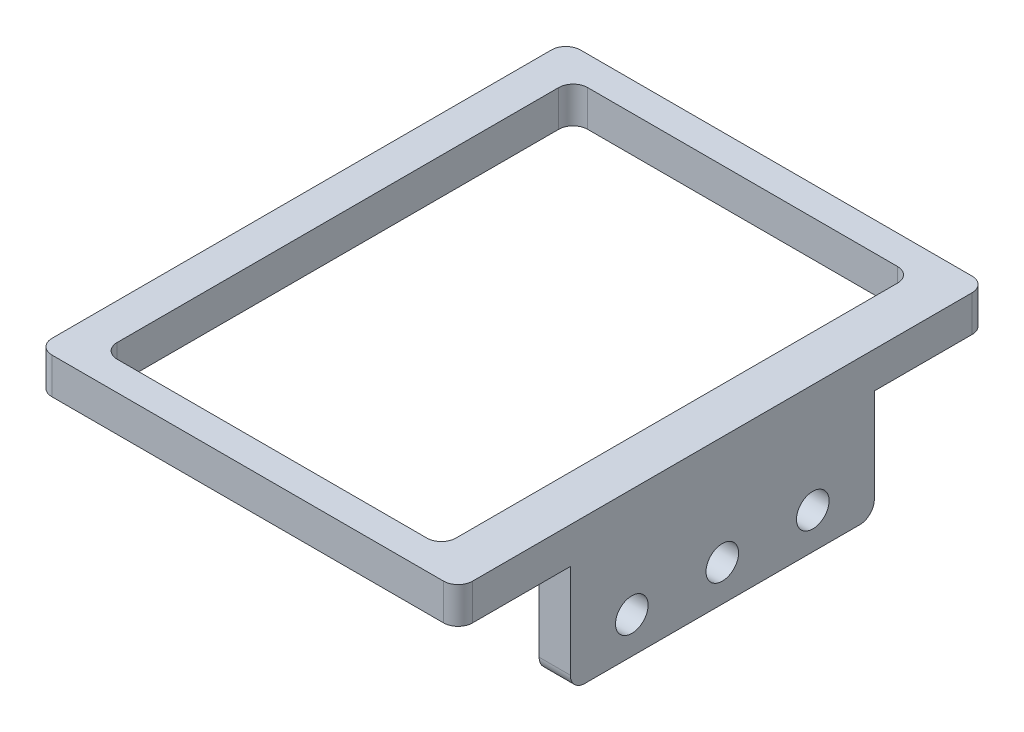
ISO-10303-21;
HEADER;
FILE_DESCRIPTION(('STEP AP214'),'2;1');
FILE_NAME('part.step','',(''),(''),'','','');
FILE_SCHEMA(('AUTOMOTIVE_DESIGN { 1 0 10303 214 1 1 1 1 }'));
ENDSEC;
DATA;
#1=APPLICATION_CONTEXT('core data for automotive mechanical design processes');
#2=APPLICATION_PROTOCOL_DEFINITION('international standard','automotive_design',2000,#1);
#3=PRODUCT_CONTEXT('',#1,'mechanical');
#4=PRODUCT('Part','Part','',(#3));
#5=PRODUCT_RELATED_PRODUCT_CATEGORY('part','',(#4));
#6=PRODUCT_DEFINITION_FORMATION('','',#4);
#7=PRODUCT_DEFINITION_CONTEXT('part definition',#1,'design');
#8=PRODUCT_DEFINITION('design','',#6,#7);
#9=PRODUCT_DEFINITION_SHAPE('','',#8);
#10=(LENGTH_UNIT() NAMED_UNIT(*) SI_UNIT(.MILLI.,.METRE.));
#11=(NAMED_UNIT(*) PLANE_ANGLE_UNIT() SI_UNIT($,.RADIAN.));
#12=(NAMED_UNIT(*) SI_UNIT($,.STERADIAN.) SOLID_ANGLE_UNIT());
#13=UNCERTAINTY_MEASURE_WITH_UNIT(LENGTH_MEASURE(1.E-05),#10,'distance_accuracy_value','');
#14=(GEOMETRIC_REPRESENTATION_CONTEXT(3) GLOBAL_UNCERTAINTY_ASSIGNED_CONTEXT((#13)) GLOBAL_UNIT_ASSIGNED_CONTEXT((#10,
#11,#12)) REPRESENTATION_CONTEXT('',''));
#15=CARTESIAN_POINT('',(0.,0.,0.));
#16=DIRECTION('',(0.,0.,1.));
#17=DIRECTION('',(1.,0.,0.));
#18=AXIS2_PLACEMENT_3D('',#15,#16,#17);
#19=CARTESIAN_POINT('',(0.,0.,0.));
#20=DIRECTION('',(0.,1.,0.));
#21=DIRECTION('',(1.,0.,0.));
#22=AXIS2_PLACEMENT_3D('',#19,#20,#21);
#23=PLANE('',#22);
#24=CARTESIAN_POINT('',(-21.4,0.,30.5));
#25=DIRECTION('',(0.,-1.,0.));
#26=DIRECTION('',(-0.707106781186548,0.,0.707106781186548));
#27=AXIS2_PLACEMENT_3D('',#24,#25,#26);
#28=CIRCLE('',#27,2.);
#29=CARTESIAN_POINT('',(-21.4,0.,32.5));
#30=VERTEX_POINT('',#29);
#31=CARTESIAN_POINT('',(-23.4,0.,30.5));
#32=VERTEX_POINT('',#31);
#33=EDGE_CURVE('E318',#30,#32,#28,.T.);
#34=ORIENTED_EDGE('',*,*,#33,.F.);
#35=DIRECTION('',(1.,0.,0.));
#36=VECTOR('',#35,1.);
#37=CARTESIAN_POINT('',(-23.4,0.,32.5));
#38=LINE('',#37,#36);
#39=CARTESIAN_POINT('',(21.4,0.,32.5));
#40=VERTEX_POINT('',#39);
#41=EDGE_CURVE('E313',#30,#40,#38,.T.);
#42=ORIENTED_EDGE('',*,*,#41,.T.);
#43=CARTESIAN_POINT('',(21.4,0.,30.5));
#44=DIRECTION('',(0.,-1.,0.));
#45=DIRECTION('',(0.707106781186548,0.,0.707106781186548));
#46=AXIS2_PLACEMENT_3D('',#43,#44,#45);
#47=CIRCLE('',#46,2.);
#48=CARTESIAN_POINT('',(23.4,0.,30.5));
#49=VERTEX_POINT('',#48);
#50=EDGE_CURVE('E308',#49,#40,#47,.T.);
#51=ORIENTED_EDGE('',*,*,#50,.F.);
#52=DIRECTION('',(0.,0.,1.));
#53=VECTOR('',#52,1.);
#54=CARTESIAN_POINT('',(23.4,0.,-34.));
#55=LINE('',#54,#53);
#56=CARTESIAN_POINT('',(23.4,0.,-30.5));
#57=VERTEX_POINT('',#56);
#58=EDGE_CURVE('E10',#57,#49,#55,.T.);
#59=ORIENTED_EDGE('',*,*,#58,.F.);
#60=CARTESIAN_POINT('',(21.4,0.,-30.5));
#61=DIRECTION('',(0.,-1.,0.));
#62=DIRECTION('',(0.707106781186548,0.,-0.707106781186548));
#63=AXIS2_PLACEMENT_3D('',#60,#61,#62);
#64=CIRCLE('',#63,2.);
#65=CARTESIAN_POINT('',(21.4,0.,-32.5));
#66=VERTEX_POINT('',#65);
#67=EDGE_CURVE('E293',#66,#57,#64,.T.);
#68=ORIENTED_EDGE('',*,*,#67,.F.);
#69=DIRECTION('',(-1.,0.,0.));
#70=VECTOR('',#69,1.);
#71=CARTESIAN_POINT('',(23.4,0.,-32.5));
#72=LINE('',#71,#70);
#73=CARTESIAN_POINT('',(-21.4,0.,-32.5));
#74=VERTEX_POINT('',#73);
#75=EDGE_CURVE('E288',#66,#74,#72,.T.);
#76=ORIENTED_EDGE('',*,*,#75,.T.);
#77=CARTESIAN_POINT('',(-21.4,0.,-30.5));
#78=DIRECTION('',(0.,-1.,0.));
#79=DIRECTION('',(-0.707106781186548,0.,-0.707106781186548));
#80=AXIS2_PLACEMENT_3D('',#77,#78,#79);
#81=CIRCLE('',#80,2.);
#82=CARTESIAN_POINT('',(-23.4,0.,-30.5));
#83=VERTEX_POINT('',#82);
#84=EDGE_CURVE('E282',#83,#74,#81,.T.);
#85=ORIENTED_EDGE('',*,*,#84,.F.);
#86=DIRECTION('',(0.,0.,-1.));
#87=VECTOR('',#86,1.);
#88=CARTESIAN_POINT('',(-23.4,0.,34.));
#89=LINE('',#88,#87);
#90=EDGE_CURVE('E25',#32,#83,#89,.T.);
#91=ORIENTED_EDGE('',*,*,#90,.F.);
#92=EDGE_LOOP('',(#34,#42,#51,#59,#68,#76,#85,#91));
#93=FACE_BOUND('',#92,.T.);
#94=CARTESIAN_POINT('',(-26.4,0.,34.5));
#95=DIRECTION('',(0.,1.,0.));
#96=DIRECTION('',(-0.707106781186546,0.,0.707106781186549));
#97=AXIS2_PLACEMENT_3D('',#94,#95,#96);
#98=CIRCLE('',#97,2.);
#99=CARTESIAN_POINT('',(-28.4,0.,34.5));
#100=VERTEX_POINT('',#99);
#101=CARTESIAN_POINT('',(-26.4,0.,36.5));
#102=VERTEX_POINT('',#101);
#103=EDGE_CURVE('E506',#100,#102,#98,.T.);
#104=ORIENTED_EDGE('',*,*,#103,.F.);
#105=DIRECTION('',(0.,0.,-1.));
#106=VECTOR('',#105,1.);
#107=CARTESIAN_POINT('',(-28.4,0.,36.));
#108=LINE('',#107,#106);
#109=CARTESIAN_POINT('',(-28.4,0.,-34.5));
#110=VERTEX_POINT('',#109);
#111=EDGE_CURVE('E460',#100,#110,#108,.T.);
#112=ORIENTED_EDGE('',*,*,#111,.T.);
#113=CARTESIAN_POINT('',(-26.4,0.,-34.5));
#114=DIRECTION('',(0.,1.,0.));
#115=DIRECTION('',(-0.707106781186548,0.,-0.707106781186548));
#116=AXIS2_PLACEMENT_3D('',#113,#114,#115);
#117=CIRCLE('',#116,2.);
#118=CARTESIAN_POINT('',(-26.4,0.,-36.5));
#119=VERTEX_POINT('',#118);
#120=EDGE_CURVE('E342',#119,#110,#117,.T.);
#121=ORIENTED_EDGE('',*,*,#120,.F.);
#122=DIRECTION('',(1.,0.,0.));
#123=VECTOR('',#122,1.);
#124=CARTESIAN_POINT('',(-13.875,0.,-36.5));
#125=LINE('',#124,#123);
#126=CARTESIAN_POINT('',(27.7,0.,-36.5));
#127=VERTEX_POINT('',#126);
#128=EDGE_CURVE('E333',#119,#127,#125,.T.);
#129=ORIENTED_EDGE('',*,*,#128,.T.);
#130=CARTESIAN_POINT('',(27.7,0.,-34.5));
#131=DIRECTION('',(0.,1.,0.));
#132=DIRECTION('',(0.707106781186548,0.,-0.707106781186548));
#133=AXIS2_PLACEMENT_3D('',#130,#131,#132);
#134=CIRCLE('',#133,2.);
#135=CARTESIAN_POINT('',(29.7,0.,-34.5));
#136=VERTEX_POINT('',#135);
#137=EDGE_CURVE('E350',#136,#127,#134,.T.);
#138=ORIENTED_EDGE('',*,*,#137,.F.);
#139=DIRECTION('',(0.,0.,-1.));
#140=VECTOR('',#139,1.);
#141=CARTESIAN_POINT('',(29.7,0.,-21.));
#142=LINE('',#141,#140);
#143=CARTESIAN_POINT('',(29.7,0.,-21.));
#144=VERTEX_POINT('',#143);
#145=EDGE_CURVE('E370',#144,#136,#142,.T.);
#146=ORIENTED_EDGE('',*,*,#145,.F.);
#147=DIRECTION('',(1.,0.,0.));
#148=VECTOR('',#147,1.);
#149=CARTESIAN_POINT('',(27.55,0.,-21.));
#150=LINE('',#149,#148);
#151=CARTESIAN_POINT('',(25.4,0.,-21.));
#152=VERTEX_POINT('',#151);
#153=EDGE_CURVE('E281',#152,#144,#150,.T.);
#154=ORIENTED_EDGE('',*,*,#153,.F.);
#155=DIRECTION('',(0.,0.,-1.));
#156=VECTOR('',#155,1.);
#157=CARTESIAN_POINT('',(25.4,0.,36.));
#158=LINE('',#157,#156);
#159=CARTESIAN_POINT('',(25.4,0.,21.));
#160=VERTEX_POINT('',#159);
#161=EDGE_CURVE('E301',#160,#152,#158,.T.);
#162=ORIENTED_EDGE('',*,*,#161,.F.);
#163=DIRECTION('',(-1.,0.,0.));
#164=VECTOR('',#163,1.);
#165=CARTESIAN_POINT('',(29.7,0.,21.));
#166=LINE('',#165,#164);
#167=CARTESIAN_POINT('',(29.7,0.,21.));
#168=VERTEX_POINT('',#167);
#169=EDGE_CURVE('E38',#168,#160,#166,.T.);
#170=ORIENTED_EDGE('',*,*,#169,.F.);
#171=DIRECTION('',(0.,0.,-1.));
#172=VECTOR('',#171,1.);
#173=CARTESIAN_POINT('',(29.7,0.,36.));
#174=LINE('',#173,#172);
#175=CARTESIAN_POINT('',(29.7,0.,34.5));
#176=VERTEX_POINT('',#175);
#177=EDGE_CURVE('E396',#176,#168,#174,.T.);
#178=ORIENTED_EDGE('',*,*,#177,.F.);
#179=CARTESIAN_POINT('',(27.7,0.,34.5));
#180=DIRECTION('',(0.,1.,0.));
#181=DIRECTION('',(0.707106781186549,0.,0.707106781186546));
#182=AXIS2_PLACEMENT_3D('',#179,#180,#181);
#183=CIRCLE('',#182,2.);
#184=CARTESIAN_POINT('',(27.7,0.,36.5));
#185=VERTEX_POINT('',#184);
#186=EDGE_CURVE('E410',#185,#176,#183,.T.);
#187=ORIENTED_EDGE('',*,*,#186,.F.);
#188=DIRECTION('',(-1.,0.,0.));
#189=VECTOR('',#188,1.);
#190=CARTESIAN_POINT('',(15.175,0.,36.5));
#191=LINE('',#190,#189);
#192=EDGE_CURVE('E332',#185,#102,#191,.T.);
#193=ORIENTED_EDGE('',*,*,#192,.T.);
#194=EDGE_LOOP('',(#104,#112,#121,#129,#138,#146,#154,#162,#170,#178,#187,#193));
#195=FACE_BOUND('',#194,.T.);
#196=ADVANCED_FACE('F16',(#93,#195),#23,.F.);
#197=CARTESIAN_POINT('',(23.4,0.,-34.));
#198=DIRECTION('',(-1.,0.,0.));
#199=DIRECTION('',(0.,0.,1.));
#200=AXIS2_PLACEMENT_3D('',#197,#198,#199);
#201=PLANE('',#200);
#202=DIRECTION('',(0.,-1.,0.));
#203=VECTOR('',#202,1.);
#204=CARTESIAN_POINT('',(23.4,0.,30.5));
#205=LINE('',#204,#203);
#206=CARTESIAN_POINT('',(23.4,5.,30.5));
#207=VERTEX_POINT('',#206);
#208=EDGE_CURVE('E304',#207,#49,#205,.T.);
#209=ORIENTED_EDGE('',*,*,#208,.F.);
#210=DIRECTION('',(0.,0.,1.));
#211=VECTOR('',#210,1.);
#212=CARTESIAN_POINT('',(23.4,5.,-34.));
#213=LINE('',#212,#211);
#214=CARTESIAN_POINT('',(23.4,5.,-30.5));
#215=VERTEX_POINT('',#214);
#216=EDGE_CURVE('E451',#215,#207,#213,.T.);
#217=ORIENTED_EDGE('',*,*,#216,.F.);
#218=DIRECTION('',(0.,1.,0.));
#219=VECTOR('',#218,1.);
#220=CARTESIAN_POINT('',(23.4,0.,-30.5));
#221=LINE('',#220,#219);
#222=EDGE_CURVE('E297',#57,#215,#221,.T.);
#223=ORIENTED_EDGE('',*,*,#222,.F.);
#224=ORIENTED_EDGE('',*,*,#58,.T.);
#225=EDGE_LOOP('',(#209,#217,#223,#224));
#226=FACE_BOUND('',#225,.T.);
#227=ADVANCED_FACE('F584',(#226),#201,.T.);
#228=CARTESIAN_POINT('',(-23.4,0.,34.));
#229=DIRECTION('',(1.,0.,0.));
#230=DIRECTION('',(0.,0.,-1.));
#231=AXIS2_PLACEMENT_3D('',#228,#229,#230);
#232=PLANE('',#231);
#233=DIRECTION('',(0.,1.,0.));
#234=VECTOR('',#233,1.);
#235=CARTESIAN_POINT('',(-23.4,0.,30.5));
#236=LINE('',#235,#234);
#237=CARTESIAN_POINT('',(-23.4,5.,30.5));
#238=VERTEX_POINT('',#237);
#239=EDGE_CURVE('E314',#32,#238,#236,.T.);
#240=ORIENTED_EDGE('',*,*,#239,.F.);
#241=ORIENTED_EDGE('',*,*,#90,.T.);
#242=DIRECTION('',(0.,-1.,0.));
#243=VECTOR('',#242,1.);
#244=CARTESIAN_POINT('',(-23.4,0.,-30.5));
#245=LINE('',#244,#243);
#246=CARTESIAN_POINT('',(-23.4,5.,-30.5));
#247=VERTEX_POINT('',#246);
#248=EDGE_CURVE('E277',#247,#83,#245,.T.);
#249=ORIENTED_EDGE('',*,*,#248,.F.);
#250=DIRECTION('',(0.,0.,-1.));
#251=VECTOR('',#250,1.);
#252=CARTESIAN_POINT('',(-23.4,5.,34.));
#253=LINE('',#252,#251);
#254=EDGE_CURVE('E428',#238,#247,#253,.T.);
#255=ORIENTED_EDGE('',*,*,#254,.F.);
#256=EDGE_LOOP('',(#240,#241,#249,#255));
#257=FACE_BOUND('',#256,.T.);
#258=ADVANCED_FACE('F615',(#257),#232,.T.);
#259=CARTESIAN_POINT('',(29.7,5.,21.));
#260=DIRECTION('',(0.,0.,1.));
#261=DIRECTION('',(1.,0.,0.));
#262=AXIS2_PLACEMENT_3D('',#259,#260,#261);
#263=PLANE('',#262);
#264=ORIENTED_EDGE('',*,*,#169,.T.);
#265=DIRECTION('',(0.,-1.,0.));
#266=VECTOR('',#265,1.);
#267=CARTESIAN_POINT('',(25.4,5.,21.));
#268=LINE('',#267,#266);
#269=CARTESIAN_POINT('',(25.4,-13.,21.));
#270=VERTEX_POINT('',#269);
#271=EDGE_CURVE('E211',#160,#270,#268,.T.);
#272=ORIENTED_EDGE('',*,*,#271,.T.);
#273=DIRECTION('',(-1.,0.,0.));
#274=VECTOR('',#273,1.);
#275=CARTESIAN_POINT('',(28.625,-13.,21.));
#276=LINE('',#275,#274);
#277=CARTESIAN_POINT('',(29.7,-13.,21.));
#278=VERTEX_POINT('',#277);
#279=EDGE_CURVE('E263',#278,#270,#276,.T.);
#280=ORIENTED_EDGE('',*,*,#279,.F.);
#281=DIRECTION('',(0.,-1.,0.));
#282=VECTOR('',#281,1.);
#283=CARTESIAN_POINT('',(29.7,5.,21.));
#284=LINE('',#283,#282);
#285=EDGE_CURVE('E389',#168,#278,#284,.T.);
#286=ORIENTED_EDGE('',*,*,#285,.F.);
#287=EDGE_LOOP('',(#264,#272,#280,#286));
#288=FACE_BOUND('',#287,.T.);
#289=ADVANCED_FACE('F637',(#288),#263,.T.);
#290=CARTESIAN_POINT('',(25.4,5.,21.));
#291=DIRECTION('',(-1.,0.,0.));
#292=DIRECTION('',(0.,0.,1.));
#293=AXIS2_PLACEMENT_3D('',#290,#291,#292);
#294=PLANE('',#293);
#295=CARTESIAN_POINT('',(25.4,-10.,-12.5));
#296=DIRECTION('',(1.,0.,0.));
#297=DIRECTION('',(0.,0.,-1.));
#298=AXIS2_PLACEMENT_3D('',#295,#296,#297);
#299=CIRCLE('',#298,3.75);
#300=CARTESIAN_POINT('',(25.4,-10.,-8.75));
#301=VERTEX_POINT('',#300);
#302=EDGE_CURVE('E203',#301,#301,#299,.T.);
#303=ORIENTED_EDGE('',*,*,#302,.T.);
#304=EDGE_LOOP('',(#303));
#305=FACE_BOUND('',#304,.T.);
#306=CARTESIAN_POINT('',(25.4,-10.,0.));
#307=DIRECTION('',(1.,0.,0.));
#308=DIRECTION('',(0.,0.,-1.));
#309=AXIS2_PLACEMENT_3D('',#306,#307,#308);
#310=CIRCLE('',#309,3.75);
#311=CARTESIAN_POINT('',(25.4,-10.,3.75));
#312=VERTEX_POINT('',#311);
#313=EDGE_CURVE('E229',#312,#312,#310,.T.);
#314=ORIENTED_EDGE('',*,*,#313,.T.);
#315=EDGE_LOOP('',(#314));
#316=FACE_BOUND('',#315,.T.);
#317=CARTESIAN_POINT('',(25.4,-10.,12.5));
#318=DIRECTION('',(1.,0.,0.));
#319=DIRECTION('',(0.,0.,-1.));
#320=AXIS2_PLACEMENT_3D('',#317,#318,#319);
#321=CIRCLE('',#320,3.75);
#322=CARTESIAN_POINT('',(25.4,-10.,16.25));
#323=VERTEX_POINT('',#322);
#324=EDGE_CURVE('E241',#323,#323,#321,.T.);
#325=ORIENTED_EDGE('',*,*,#324,.T.);
#326=EDGE_LOOP('',(#325));
#327=FACE_BOUND('',#326,.T.);
#328=CARTESIAN_POINT('',(25.4,-13.,19.));
#329=DIRECTION('',(1.,0.,0.));
#330=DIRECTION('',(0.,-0.707106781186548,0.707106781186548));
#331=AXIS2_PLACEMENT_3D('',#328,#329,#330);
#332=CIRCLE('',#331,2.);
#333=CARTESIAN_POINT('',(25.4,-15.,19.));
#334=VERTEX_POINT('',#333);
#335=EDGE_CURVE('E268',#270,#334,#332,.T.);
#336=ORIENTED_EDGE('',*,*,#335,.F.);
#337=ORIENTED_EDGE('',*,*,#271,.F.);
#338=ORIENTED_EDGE('',*,*,#161,.T.);
#339=DIRECTION('',(0.,-1.,0.));
#340=VECTOR('',#339,1.);
#341=CARTESIAN_POINT('',(25.4,5.,-21.));
#342=LINE('',#341,#340);
#343=CARTESIAN_POINT('',(25.4,-13.,-21.));
#344=VERTEX_POINT('',#343);
#345=EDGE_CURVE('E269',#152,#344,#342,.T.);
#346=ORIENTED_EDGE('',*,*,#345,.T.);
#347=CARTESIAN_POINT('',(25.4,-13.,-19.));
#348=DIRECTION('',(1.,0.,0.));
#349=DIRECTION('',(0.,-0.707106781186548,-0.707106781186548));
#350=AXIS2_PLACEMENT_3D('',#347,#348,#349);
#351=CIRCLE('',#350,2.);
#352=CARTESIAN_POINT('',(25.4,-15.,-19.));
#353=VERTEX_POINT('',#352);
#354=EDGE_CURVE('E253',#353,#344,#351,.T.);
#355=ORIENTED_EDGE('',*,*,#354,.F.);
#356=DIRECTION('',(0.,0.,-1.));
#357=VECTOR('',#356,1.);
#358=CARTESIAN_POINT('',(25.4,-15.,-36.));
#359=LINE('',#358,#357);
#360=EDGE_CURVE('E260',#334,#353,#359,.T.);
#361=ORIENTED_EDGE('',*,*,#360,.F.);
#362=EDGE_LOOP('',(#336,#337,#338,#346,#355,#361));
#363=FACE_BOUND('',#362,.T.);
#364=ADVANCED_FACE('F642',(#305,#316,#327,#363),#294,.T.);
#365=CARTESIAN_POINT('',(116.044008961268,-10.,-12.5));
#366=DIRECTION('',(1.,0.,0.));
#367=DIRECTION('',(0.,0.,-1.));
#368=AXIS2_PLACEMENT_3D('',#365,#366,#367);
#369=CYLINDRICAL_SURFACE('',#368,2.25);
#370=CARTESIAN_POINT('',(26.2,-10.,-12.5));
#371=DIRECTION('',(1.,0.,0.));
#372=DIRECTION('',(0.,0.,-1.));
#373=AXIS2_PLACEMENT_3D('',#370,#371,#372);
#374=CIRCLE('',#373,2.25);
#375=CARTESIAN_POINT('',(26.2,-10.,-10.25));
#376=VERTEX_POINT('',#375);
#377=EDGE_CURVE('E213',#376,#376,#374,.T.);
#378=ORIENTED_EDGE('',*,*,#377,.F.);
#379=DIRECTION('',(1.,0.,0.));
#380=VECTOR('',#379,1.);
#381=CARTESIAN_POINT('',(116.044008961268,-10.,-10.25));
#382=LINE('',#381,#380);
#383=CARTESIAN_POINT('',(29.7,-10.,-10.25));
#384=VERTEX_POINT('',#383);
#385=EDGE_CURVE('E205',#376,#384,#382,.T.);
#386=ORIENTED_EDGE('',*,*,#385,.T.);
#387=CARTESIAN_POINT('',(29.7,-10.,-12.5));
#388=DIRECTION('',(-1.,0.,0.));
#389=DIRECTION('',(0.,0.,-1.));
#390=AXIS2_PLACEMENT_3D('',#387,#388,#389);
#391=CIRCLE('',#390,2.25);
#392=EDGE_CURVE('E354',#384,#384,#391,.T.);
#393=ORIENTED_EDGE('',*,*,#392,.F.);
#394=ORIENTED_EDGE('',*,*,#385,.F.);
#395=EDGE_LOOP('',(#378,#386,#393,#394));
#396=FACE_BOUND('',#395,.T.);
#397=ADVANCED_FACE('F645',(#396),#369,.F.);
#398=CARTESIAN_POINT('',(24.7,-10.,-12.5));
#399=DIRECTION('',(1.,0.,0.));
#400=DIRECTION('',(0.,0.,-1.));
#401=AXIS2_PLACEMENT_3D('',#398,#399,#400);
#402=CYLINDRICAL_SURFACE('',#401,3.75);
#403=ORIENTED_EDGE('',*,*,#302,.F.);
#404=DIRECTION('',(1.,0.,0.));
#405=VECTOR('',#404,1.);
#406=CARTESIAN_POINT('',(24.7,-10.,-8.75));
#407=LINE('',#406,#405);
#408=CARTESIAN_POINT('',(26.2,-10.,-8.75));
#409=VERTEX_POINT('',#408);
#410=EDGE_CURVE('E19',#301,#409,#407,.T.);
#411=ORIENTED_EDGE('',*,*,#410,.T.);
#412=CARTESIAN_POINT('',(26.2,-10.,-12.5));
#413=DIRECTION('',(1.,0.,0.));
#414=DIRECTION('',(0.,0.,-1.));
#415=AXIS2_PLACEMENT_3D('',#412,#413,#414);
#416=CIRCLE('',#415,3.75);
#417=EDGE_CURVE('E202',#409,#409,#416,.T.);
#418=ORIENTED_EDGE('',*,*,#417,.T.);
#419=ORIENTED_EDGE('',*,*,#410,.F.);
#420=EDGE_LOOP('',(#403,#411,#418,#419));
#421=FACE_BOUND('',#420,.T.);
#422=ADVANCED_FACE('F200',(#421),#402,.F.);
#423=CARTESIAN_POINT('',(26.2,-10.,-12.5));
#424=DIRECTION('',(1.,0.,0.));
#425=DIRECTION('',(0.,0.,-1.));
#426=AXIS2_PLACEMENT_3D('',#423,#424,#425);
#427=PLANE('',#426);
#428=ORIENTED_EDGE('',*,*,#377,.T.);
#429=EDGE_LOOP('',(#428));
#430=FACE_BOUND('',#429,.T.);
#431=ORIENTED_EDGE('',*,*,#417,.F.);
#432=EDGE_LOOP('',(#431));
#433=FACE_BOUND('',#432,.T.);
#434=ADVANCED_FACE('F651',(#430,#433),#427,.F.);
#435=CARTESIAN_POINT('',(116.044008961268,-10.,0.));
#436=DIRECTION('',(1.,0.,0.));
#437=DIRECTION('',(0.,0.,-1.));
#438=AXIS2_PLACEMENT_3D('',#435,#436,#437);
#439=CYLINDRICAL_SURFACE('',#438,2.25);
#440=CARTESIAN_POINT('',(26.2,-10.,0.));
#441=DIRECTION('',(1.,0.,0.));
#442=DIRECTION('',(0.,0.,-1.));
#443=AXIS2_PLACEMENT_3D('',#440,#441,#442);
#444=CIRCLE('',#443,2.25);
#445=CARTESIAN_POINT('',(26.2,-10.,2.25));
#446=VERTEX_POINT('',#445);
#447=EDGE_CURVE('E230',#446,#446,#444,.T.);
#448=ORIENTED_EDGE('',*,*,#447,.F.);
#449=DIRECTION('',(1.,0.,0.));
#450=VECTOR('',#449,1.);
#451=CARTESIAN_POINT('',(116.044008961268,-10.,2.25));
#452=LINE('',#451,#450);
#453=CARTESIAN_POINT('',(29.7,-10.,2.25));
#454=VERTEX_POINT('',#453);
#455=EDGE_CURVE('E223',#446,#454,#452,.T.);
#456=ORIENTED_EDGE('',*,*,#455,.T.);
#457=CARTESIAN_POINT('',(29.7,-10.,0.));
#458=DIRECTION('',(-1.,0.,0.));
#459=DIRECTION('',(0.,0.,-1.));
#460=AXIS2_PLACEMENT_3D('',#457,#458,#459);
#461=CIRCLE('',#460,2.25);
#462=EDGE_CURVE('E355',#454,#454,#461,.T.);
#463=ORIENTED_EDGE('',*,*,#462,.F.);
#464=ORIENTED_EDGE('',*,*,#455,.F.);
#465=EDGE_LOOP('',(#448,#456,#463,#464));
#466=FACE_BOUND('',#465,.T.);
#467=ADVANCED_FACE('F654',(#466),#439,.F.);
#468=CARTESIAN_POINT('',(24.7,-10.,0.));
#469=DIRECTION('',(1.,0.,0.));
#470=DIRECTION('',(0.,0.,-1.));
#471=AXIS2_PLACEMENT_3D('',#468,#469,#470);
#472=CYLINDRICAL_SURFACE('',#471,3.75);
#473=ORIENTED_EDGE('',*,*,#313,.F.);
#474=DIRECTION('',(1.,0.,0.));
#475=VECTOR('',#474,1.);
#476=CARTESIAN_POINT('',(24.7,-10.,3.75));
#477=LINE('',#476,#475);
#478=CARTESIAN_POINT('',(26.2,-10.,3.75));
#479=VERTEX_POINT('',#478);
#480=EDGE_CURVE('E226',#312,#479,#477,.T.);
#481=ORIENTED_EDGE('',*,*,#480,.T.);
#482=CARTESIAN_POINT('',(26.2,-10.,0.));
#483=DIRECTION('',(1.,0.,0.));
#484=DIRECTION('',(0.,0.,-1.));
#485=AXIS2_PLACEMENT_3D('',#482,#483,#484);
#486=CIRCLE('',#485,3.75);
#487=EDGE_CURVE('E234',#479,#479,#486,.T.);
#488=ORIENTED_EDGE('',*,*,#487,.T.);
#489=ORIENTED_EDGE('',*,*,#480,.F.);
#490=EDGE_LOOP('',(#473,#481,#488,#489));
#491=FACE_BOUND('',#490,.T.);
#492=ADVANCED_FACE('F658',(#491),#472,.F.);
#493=CARTESIAN_POINT('',(26.2,-10.,0.));
#494=DIRECTION('',(1.,0.,0.));
#495=DIRECTION('',(0.,0.,-1.));
#496=AXIS2_PLACEMENT_3D('',#493,#494,#495);
#497=PLANE('',#496);
#498=ORIENTED_EDGE('',*,*,#447,.T.);
#499=EDGE_LOOP('',(#498));
#500=FACE_BOUND('',#499,.T.);
#501=ORIENTED_EDGE('',*,*,#487,.F.);
#502=EDGE_LOOP('',(#501));
#503=FACE_BOUND('',#502,.T.);
#504=ADVANCED_FACE('F662',(#500,#503),#497,.F.);
#505=CARTESIAN_POINT('',(116.044008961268,-10.,12.5));
#506=DIRECTION('',(1.,0.,0.));
#507=DIRECTION('',(0.,0.,-1.));
#508=AXIS2_PLACEMENT_3D('',#505,#506,#507);
#509=CYLINDRICAL_SURFACE('',#508,2.25);
#510=CARTESIAN_POINT('',(26.2,-10.,12.5));
#511=DIRECTION('',(1.,0.,0.));
#512=DIRECTION('',(0.,0.,-1.));
#513=AXIS2_PLACEMENT_3D('',#510,#511,#512);
#514=CIRCLE('',#513,2.25);
#515=CARTESIAN_POINT('',(26.2,-10.,14.75));
#516=VERTEX_POINT('',#515);
#517=EDGE_CURVE('E245',#516,#516,#514,.T.);
#518=ORIENTED_EDGE('',*,*,#517,.F.);
#519=DIRECTION('',(1.,0.,0.));
#520=VECTOR('',#519,1.);
#521=CARTESIAN_POINT('',(116.044008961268,-10.,14.75));
#522=LINE('',#521,#520);
#523=CARTESIAN_POINT('',(29.7,-10.,14.75));
#524=VERTEX_POINT('',#523);
#525=EDGE_CURVE('E235',#516,#524,#522,.T.);
#526=ORIENTED_EDGE('',*,*,#525,.T.);
#527=CARTESIAN_POINT('',(29.7,-10.,12.5));
#528=DIRECTION('',(-1.,0.,0.));
#529=DIRECTION('',(0.,0.,-1.));
#530=AXIS2_PLACEMENT_3D('',#527,#528,#529);
#531=CIRCLE('',#530,2.25);
#532=EDGE_CURVE('E359',#524,#524,#531,.T.);
#533=ORIENTED_EDGE('',*,*,#532,.F.);
#534=ORIENTED_EDGE('',*,*,#525,.F.);
#535=EDGE_LOOP('',(#518,#526,#533,#534));
#536=FACE_BOUND('',#535,.T.);
#537=ADVANCED_FACE('F666',(#536),#509,.F.);
#538=CARTESIAN_POINT('',(24.7,-10.,12.5));
#539=DIRECTION('',(1.,0.,0.));
#540=DIRECTION('',(0.,0.,-1.));
#541=AXIS2_PLACEMENT_3D('',#538,#539,#540);
#542=CYLINDRICAL_SURFACE('',#541,3.75);
#543=ORIENTED_EDGE('',*,*,#324,.F.);
#544=DIRECTION('',(1.,0.,0.));
#545=VECTOR('',#544,1.);
#546=CARTESIAN_POINT('',(24.7,-10.,16.25));
#547=LINE('',#546,#545);
#548=CARTESIAN_POINT('',(26.2,-10.,16.25));
#549=VERTEX_POINT('',#548);
#550=EDGE_CURVE('E238',#323,#549,#547,.T.);
#551=ORIENTED_EDGE('',*,*,#550,.T.);
#552=CARTESIAN_POINT('',(26.2,-10.,12.5));
#553=DIRECTION('',(1.,0.,0.));
#554=DIRECTION('',(0.,0.,-1.));
#555=AXIS2_PLACEMENT_3D('',#552,#553,#554);
#556=CIRCLE('',#555,3.75);
#557=EDGE_CURVE('E249',#549,#549,#556,.T.);
#558=ORIENTED_EDGE('',*,*,#557,.T.);
#559=ORIENTED_EDGE('',*,*,#550,.F.);
#560=EDGE_LOOP('',(#543,#551,#558,#559));
#561=FACE_BOUND('',#560,.T.);
#562=ADVANCED_FACE('F670',(#561),#542,.F.);
#563=CARTESIAN_POINT('',(26.2,-10.,12.5));
#564=DIRECTION('',(1.,0.,0.));
#565=DIRECTION('',(0.,0.,-1.));
#566=AXIS2_PLACEMENT_3D('',#563,#564,#565);
#567=PLANE('',#566);
#568=ORIENTED_EDGE('',*,*,#517,.T.);
#569=EDGE_LOOP('',(#568));
#570=FACE_BOUND('',#569,.T.);
#571=ORIENTED_EDGE('',*,*,#557,.F.);
#572=EDGE_LOOP('',(#571));
#573=FACE_BOUND('',#572,.T.);
#574=ADVANCED_FACE('F674',(#570,#573),#567,.F.);
#575=CARTESIAN_POINT('',(26.475,-13.,-19.));
#576=DIRECTION('',(1.,0.,0.));
#577=DIRECTION('',(0.,-0.707106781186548,-0.707106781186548));
#578=AXIS2_PLACEMENT_3D('',#575,#576,#577);
#579=CYLINDRICAL_SURFACE('',#578,2.);
#580=CARTESIAN_POINT('',(29.7,-13.,-19.));
#581=DIRECTION('',(-1.,0.,0.));
#582=DIRECTION('',(0.,-0.707106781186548,-0.707106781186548));
#583=AXIS2_PLACEMENT_3D('',#580,#581,#582);
#584=CIRCLE('',#583,2.);
#585=CARTESIAN_POINT('',(29.7,-13.,-21.));
#586=VERTEX_POINT('',#585);
#587=CARTESIAN_POINT('',(29.7,-15.,-19.));
#588=VERTEX_POINT('',#587);
#589=EDGE_CURVE('E380',#586,#588,#584,.T.);
#590=ORIENTED_EDGE('',*,*,#589,.T.);
#591=DIRECTION('',(-1.,0.,0.));
#592=VECTOR('',#591,1.);
#593=CARTESIAN_POINT('',(26.475,-15.,-19.));
#594=LINE('',#593,#592);
#595=EDGE_CURVE('E256',#588,#353,#594,.T.);
#596=ORIENTED_EDGE('',*,*,#595,.T.);
#597=ORIENTED_EDGE('',*,*,#354,.T.);
#598=DIRECTION('',(1.,0.,0.));
#599=VECTOR('',#598,1.);
#600=CARTESIAN_POINT('',(26.475,-13.,-21.));
#601=LINE('',#600,#599);
#602=EDGE_CURVE('E273',#344,#586,#601,.T.);
#603=ORIENTED_EDGE('',*,*,#602,.T.);
#604=EDGE_LOOP('',(#590,#596,#597,#603));
#605=FACE_BOUND('',#604,.T.);
#606=ADVANCED_FACE('F678',(#605),#579,.T.);
#607=CARTESIAN_POINT('',(27.55,-15.,0.));
#608=DIRECTION('',(0.,-1.,0.));
#609=DIRECTION('',(0.,0.,-1.));
#610=AXIS2_PLACEMENT_3D('',#607,#608,#609);
#611=PLANE('',#610);
#612=DIRECTION('',(1.,0.,0.));
#613=VECTOR('',#612,1.);
#614=CARTESIAN_POINT('',(28.625,-15.,19.));
#615=LINE('',#614,#613);
#616=CARTESIAN_POINT('',(29.7,-15.,19.));
#617=VERTEX_POINT('',#616);
#618=EDGE_CURVE('E265',#334,#617,#615,.T.);
#619=ORIENTED_EDGE('',*,*,#618,.F.);
#620=ORIENTED_EDGE('',*,*,#360,.T.);
#621=ORIENTED_EDGE('',*,*,#595,.F.);
#622=DIRECTION('',(0.,0.,1.));
#623=VECTOR('',#622,1.);
#624=CARTESIAN_POINT('',(29.7,-15.,21.));
#625=LINE('',#624,#623);
#626=EDGE_CURVE('E384',#588,#617,#625,.T.);
#627=ORIENTED_EDGE('',*,*,#626,.T.);
#628=EDGE_LOOP('',(#619,#620,#621,#627));
#629=FACE_BOUND('',#628,.T.);
#630=ADVANCED_FACE('F682',(#629),#611,.T.);
#631=CARTESIAN_POINT('',(28.625,-13.,19.));
#632=DIRECTION('',(-1.,0.,0.));
#633=DIRECTION('',(0.,-0.707106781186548,0.707106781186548));
#634=AXIS2_PLACEMENT_3D('',#631,#632,#633);
#635=CYLINDRICAL_SURFACE('',#634,2.);
#636=ORIENTED_EDGE('',*,*,#335,.T.);
#637=ORIENTED_EDGE('',*,*,#618,.T.);
#638=CARTESIAN_POINT('',(29.7,-13.,19.));
#639=DIRECTION('',(-1.,0.,0.));
#640=DIRECTION('',(0.,-0.707106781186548,0.707106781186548));
#641=AXIS2_PLACEMENT_3D('',#638,#639,#640);
#642=CIRCLE('',#641,2.);
#643=EDGE_CURVE('E385',#617,#278,#642,.T.);
#644=ORIENTED_EDGE('',*,*,#643,.T.);
#645=ORIENTED_EDGE('',*,*,#279,.T.);
#646=EDGE_LOOP('',(#636,#637,#644,#645));
#647=FACE_BOUND('',#646,.T.);
#648=ADVANCED_FACE('F686',(#647),#635,.T.);
#649=CARTESIAN_POINT('',(25.4,5.,-21.));
#650=DIRECTION('',(0.,0.,-1.));
#651=DIRECTION('',(0.,-1.,0.));
#652=AXIS2_PLACEMENT_3D('',#649,#650,#651);
#653=PLANE('',#652);
#654=ORIENTED_EDGE('',*,*,#153,.T.);
#655=DIRECTION('',(0.,-1.,0.));
#656=VECTOR('',#655,1.);
#657=CARTESIAN_POINT('',(29.7,5.,-21.));
#658=LINE('',#657,#656);
#659=EDGE_CURVE('E376',#144,#586,#658,.T.);
#660=ORIENTED_EDGE('',*,*,#659,.T.);
#661=ORIENTED_EDGE('',*,*,#602,.F.);
#662=ORIENTED_EDGE('',*,*,#345,.F.);
#663=EDGE_LOOP('',(#654,#660,#661,#662));
#664=FACE_BOUND('',#663,.T.);
#665=ADVANCED_FACE('F690',(#664),#653,.T.);
#666=CARTESIAN_POINT('',(-21.4,0.,-30.5));
#667=DIRECTION('',(0.,1.,0.));
#668=DIRECTION('',(-0.707106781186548,0.,-0.707106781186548));
#669=AXIS2_PLACEMENT_3D('',#666,#667,#668);
#670=CYLINDRICAL_SURFACE('',#669,2.);
#671=ORIENTED_EDGE('',*,*,#84,.T.);
#672=DIRECTION('',(0.,1.,0.));
#673=VECTOR('',#672,1.);
#674=CARTESIAN_POINT('',(-21.4,0.,-32.5));
#675=LINE('',#674,#673);
#676=CARTESIAN_POINT('',(-21.4,5.,-32.5));
#677=VERTEX_POINT('',#676);
#678=EDGE_CURVE('E292',#74,#677,#675,.T.);
#679=ORIENTED_EDGE('',*,*,#678,.T.);
#680=CARTESIAN_POINT('',(-21.4,5.,-30.5));
#681=DIRECTION('',(0.,1.,0.));
#682=DIRECTION('',(-0.707106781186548,0.,-0.707106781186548));
#683=AXIS2_PLACEMENT_3D('',#680,#681,#682);
#684=CIRCLE('',#683,2.);
#685=EDGE_CURVE('E422',#677,#247,#684,.T.);
#686=ORIENTED_EDGE('',*,*,#685,.T.);
#687=ORIENTED_EDGE('',*,*,#248,.T.);
#688=EDGE_LOOP('',(#671,#679,#686,#687));
#689=FACE_BOUND('',#688,.T.);
#690=ADVANCED_FACE('F611',(#689),#670,.F.);
#691=CARTESIAN_POINT('',(-23.4,0.,-32.5));
#692=DIRECTION('',(0.,0.,1.));
#693=DIRECTION('',(1.,0.,0.));
#694=AXIS2_PLACEMENT_3D('',#691,#692,#693);
#695=PLANE('',#694);
#696=DIRECTION('',(0.,-1.,0.));
#697=VECTOR('',#696,1.);
#698=CARTESIAN_POINT('',(21.4,0.,-32.5));
#699=LINE('',#698,#697);
#700=CARTESIAN_POINT('',(21.4,5.,-32.5));
#701=VERTEX_POINT('',#700);
#702=EDGE_CURVE('E298',#701,#66,#699,.T.);
#703=ORIENTED_EDGE('',*,*,#702,.F.);
#704=DIRECTION('',(-1.,0.,0.));
#705=VECTOR('',#704,1.);
#706=CARTESIAN_POINT('',(-11.7,5.,-32.5));
#707=LINE('',#706,#705);
#708=EDGE_CURVE('E418',#701,#677,#707,.T.);
#709=ORIENTED_EDGE('',*,*,#708,.T.);
#710=ORIENTED_EDGE('',*,*,#678,.F.);
#711=ORIENTED_EDGE('',*,*,#75,.F.);
#712=EDGE_LOOP('',(#703,#709,#710,#711));
#713=FACE_BOUND('',#712,.T.);
#714=ADVANCED_FACE('F609',(#713),#695,.T.);
#715=CARTESIAN_POINT('',(21.4,0.,-30.5));
#716=DIRECTION('',(0.,-1.,0.));
#717=DIRECTION('',(0.707106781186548,0.,-0.707106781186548));
#718=AXIS2_PLACEMENT_3D('',#715,#716,#717);
#719=CYLINDRICAL_SURFACE('',#718,2.);
#720=CARTESIAN_POINT('',(21.4,5.,-30.5));
#721=DIRECTION('',(0.,1.,0.));
#722=DIRECTION('',(0.707106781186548,0.,-0.707106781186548));
#723=AXIS2_PLACEMENT_3D('',#720,#721,#722);
#724=CIRCLE('',#723,2.);
#725=EDGE_CURVE('E414',#215,#701,#724,.T.);
#726=ORIENTED_EDGE('',*,*,#725,.T.);
#727=ORIENTED_EDGE('',*,*,#702,.T.);
#728=ORIENTED_EDGE('',*,*,#67,.T.);
#729=ORIENTED_EDGE('',*,*,#222,.T.);
#730=EDGE_LOOP('',(#726,#727,#728,#729));
#731=FACE_BOUND('',#730,.T.);
#732=ADVANCED_FACE('F605',(#731),#719,.F.);
#733=CARTESIAN_POINT('',(21.4,0.,30.5));
#734=DIRECTION('',(0.,1.,0.));
#735=DIRECTION('',(0.707106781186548,0.,0.707106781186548));
#736=AXIS2_PLACEMENT_3D('',#733,#734,#735);
#737=CYLINDRICAL_SURFACE('',#736,2.);
#738=ORIENTED_EDGE('',*,*,#50,.T.);
#739=DIRECTION('',(0.,1.,0.));
#740=VECTOR('',#739,1.);
#741=CARTESIAN_POINT('',(21.4,0.,32.5));
#742=LINE('',#741,#740);
#743=CARTESIAN_POINT('',(21.4,5.,32.5));
#744=VERTEX_POINT('',#743);
#745=EDGE_CURVE('E309',#40,#744,#742,.T.);
#746=ORIENTED_EDGE('',*,*,#745,.T.);
#747=CARTESIAN_POINT('',(21.4,5.,30.5));
#748=DIRECTION('',(0.,1.,0.));
#749=DIRECTION('',(0.707106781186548,0.,0.707106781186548));
#750=AXIS2_PLACEMENT_3D('',#747,#748,#749);
#751=CIRCLE('',#750,2.);
#752=EDGE_CURVE('E437',#744,#207,#751,.T.);
#753=ORIENTED_EDGE('',*,*,#752,.T.);
#754=ORIENTED_EDGE('',*,*,#208,.T.);
#755=EDGE_LOOP('',(#738,#746,#753,#754));
#756=FACE_BOUND('',#755,.T.);
#757=ADVANCED_FACE('F590',(#756),#737,.F.);
#758=CARTESIAN_POINT('',(23.4,0.,32.5));
#759=DIRECTION('',(0.,0.,-1.));
#760=DIRECTION('',(0.,-1.,0.));
#761=AXIS2_PLACEMENT_3D('',#758,#759,#760);
#762=PLANE('',#761);
#763=DIRECTION('',(0.,-1.,0.));
#764=VECTOR('',#763,1.);
#765=CARTESIAN_POINT('',(-21.4,0.,32.5));
#766=LINE('',#765,#764);
#767=CARTESIAN_POINT('',(-21.4,5.,32.5));
#768=VERTEX_POINT('',#767);
#769=EDGE_CURVE('E325',#768,#30,#766,.T.);
#770=ORIENTED_EDGE('',*,*,#769,.F.);
#771=DIRECTION('',(1.,0.,0.));
#772=VECTOR('',#771,1.);
#773=CARTESIAN_POINT('',(11.7,5.,32.5));
#774=LINE('',#773,#772);
#775=EDGE_CURVE('E433',#768,#744,#774,.T.);
#776=ORIENTED_EDGE('',*,*,#775,.T.);
#777=ORIENTED_EDGE('',*,*,#745,.F.);
#778=ORIENTED_EDGE('',*,*,#41,.F.);
#779=EDGE_LOOP('',(#770,#776,#777,#778));
#780=FACE_BOUND('',#779,.T.);
#781=ADVANCED_FACE('F595',(#780),#762,.T.);
#782=CARTESIAN_POINT('',(-21.4,0.,30.5));
#783=DIRECTION('',(0.,-1.,0.));
#784=DIRECTION('',(-0.707106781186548,0.,0.707106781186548));
#785=AXIS2_PLACEMENT_3D('',#782,#783,#784);
#786=CYLINDRICAL_SURFACE('',#785,2.);
#787=CARTESIAN_POINT('',(-21.4,5.,30.5));
#788=DIRECTION('',(0.,1.,0.));
#789=DIRECTION('',(-0.707106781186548,0.,0.707106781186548));
#790=AXIS2_PLACEMENT_3D('',#787,#788,#789);
#791=CIRCLE('',#790,2.);
#792=EDGE_CURVE('E432',#238,#768,#791,.T.);
#793=ORIENTED_EDGE('',*,*,#792,.T.);
#794=ORIENTED_EDGE('',*,*,#769,.T.);
#795=ORIENTED_EDGE('',*,*,#33,.T.);
#796=ORIENTED_EDGE('',*,*,#239,.T.);
#797=EDGE_LOOP('',(#793,#794,#795,#796));
#798=FACE_BOUND('',#797,.T.);
#799=ADVANCED_FACE('F617',(#798),#786,.F.);
#800=CARTESIAN_POINT('',(29.7,5.,36.5));
#801=DIRECTION('',(0.,0.,1.));
#802=DIRECTION('',(1.,0.,0.));
#803=AXIS2_PLACEMENT_3D('',#800,#801,#802);
#804=PLANE('',#803);
#805=DIRECTION('',(0.,1.,0.));
#806=VECTOR('',#805,1.);
#807=CARTESIAN_POINT('',(-26.4,2.5,36.5));
#808=LINE('',#807,#806);
#809=CARTESIAN_POINT('',(-26.4,5.,36.5));
#810=VERTEX_POINT('',#809);
#811=EDGE_CURVE('E490',#102,#810,#808,.T.);
#812=ORIENTED_EDGE('',*,*,#811,.F.);
#813=ORIENTED_EDGE('',*,*,#192,.F.);
#814=DIRECTION('',(0.,-1.,0.));
#815=VECTOR('',#814,1.);
#816=CARTESIAN_POINT('',(27.7,5.,36.5));
#817=LINE('',#816,#815);
#818=CARTESIAN_POINT('',(27.7,5.,36.5));
#819=VERTEX_POINT('',#818);
#820=EDGE_CURVE('E400',#819,#185,#817,.T.);
#821=ORIENTED_EDGE('',*,*,#820,.F.);
#822=DIRECTION('',(1.,0.,0.));
#823=VECTOR('',#822,1.);
#824=CARTESIAN_POINT('',(-28.4,5.,36.5));
#825=LINE('',#824,#823);
#826=EDGE_CURVE('E456',#810,#819,#825,.T.);
#827=ORIENTED_EDGE('',*,*,#826,.F.);
#828=EDGE_LOOP('',(#812,#813,#821,#827));
#829=FACE_BOUND('',#828,.T.);
#830=ADVANCED_FACE('F619',(#829),#804,.T.);
#831=CARTESIAN_POINT('',(-28.4,5.,-36.5));
#832=DIRECTION('',(0.,0.,-1.));
#833=DIRECTION('',(-1.,0.,0.));
#834=AXIS2_PLACEMENT_3D('',#831,#832,#833);
#835=PLANE('',#834);
#836=DIRECTION('',(0.,1.,0.));
#837=VECTOR('',#836,1.);
#838=CARTESIAN_POINT('',(27.7,5.,-36.5));
#839=LINE('',#838,#837);
#840=CARTESIAN_POINT('',(27.7,5.,-36.5));
#841=VERTEX_POINT('',#840);
#842=EDGE_CURVE('E346',#127,#841,#839,.T.);
#843=ORIENTED_EDGE('',*,*,#842,.F.);
#844=ORIENTED_EDGE('',*,*,#128,.F.);
#845=DIRECTION('',(0.,-1.,0.));
#846=VECTOR('',#845,1.);
#847=CARTESIAN_POINT('',(-26.4,2.5,-36.5));
#848=LINE('',#847,#846);
#849=CARTESIAN_POINT('',(-26.4,5.,-36.5));
#850=VERTEX_POINT('',#849);
#851=EDGE_CURVE('E336',#850,#119,#848,.T.);
#852=ORIENTED_EDGE('',*,*,#851,.F.);
#853=DIRECTION('',(-1.,0.,0.));
#854=VECTOR('',#853,1.);
#855=CARTESIAN_POINT('',(29.7,5.,-36.5));
#856=LINE('',#855,#854);
#857=EDGE_CURVE('E442',#841,#850,#856,.T.);
#858=ORIENTED_EDGE('',*,*,#857,.F.);
#859=EDGE_LOOP('',(#843,#844,#852,#858));
#860=FACE_BOUND('',#859,.T.);
#861=ADVANCED_FACE('F626',(#860),#835,.T.);
#862=CARTESIAN_POINT('',(-26.4,2.5,-34.5));
#863=DIRECTION('',(0.,-1.,0.));
#864=DIRECTION('',(-0.707106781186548,0.,-0.707106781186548));
#865=AXIS2_PLACEMENT_3D('',#862,#863,#864);
#866=CYLINDRICAL_SURFACE('',#865,2.);
#867=ORIENTED_EDGE('',*,*,#120,.T.);
#868=DIRECTION('',(0.,1.,0.));
#869=VECTOR('',#868,1.);
#870=CARTESIAN_POINT('',(-28.4,2.5,-34.5));
#871=LINE('',#870,#869);
#872=CARTESIAN_POINT('',(-28.4000000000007,5.,-34.5));
#873=VERTEX_POINT('',#872);
#874=EDGE_CURVE('E468',#110,#873,#871,.T.);
#875=ORIENTED_EDGE('',*,*,#874,.T.);
#876=CARTESIAN_POINT('',(-26.4,5.,-34.5));
#877=DIRECTION('',(0.,-1.,0.));
#878=DIRECTION('',(-0.707106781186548,0.,-0.707106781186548));
#879=AXIS2_PLACEMENT_3D('',#876,#877,#878);
#880=CIRCLE('',#879,2.);
#881=EDGE_CURVE('E455',#873,#850,#880,.T.);
#882=ORIENTED_EDGE('',*,*,#881,.T.);
#883=ORIENTED_EDGE('',*,*,#851,.T.);
#884=EDGE_LOOP('',(#867,#875,#882,#883));
#885=FACE_BOUND('',#884,.T.);
#886=ADVANCED_FACE('F750',(#885),#866,.T.);
#887=CARTESIAN_POINT('',(27.7,5.,-34.5));
#888=DIRECTION('',(0.,-1.,0.));
#889=DIRECTION('',(0.707106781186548,0.,-0.707106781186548));
#890=AXIS2_PLACEMENT_3D('',#887,#888,#889);
#891=CYLINDRICAL_SURFACE('',#890,2.);
#892=ORIENTED_EDGE('',*,*,#137,.T.);
#893=ORIENTED_EDGE('',*,*,#842,.T.);
#894=CARTESIAN_POINT('',(27.7,5.,-34.5));
#895=DIRECTION('',(0.,-1.,0.));
#896=DIRECTION('',(0.707106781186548,0.,-0.707106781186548));
#897=AXIS2_PLACEMENT_3D('',#894,#895,#896);
#898=CIRCLE('',#897,2.);
#899=CARTESIAN_POINT('',(29.7,5.,-34.5));
#900=VERTEX_POINT('',#899);
#901=EDGE_CURVE('E438',#841,#900,#898,.T.);
#902=ORIENTED_EDGE('',*,*,#901,.T.);
#903=DIRECTION('',(0.,-1.,0.));
#904=VECTOR('',#903,1.);
#905=CARTESIAN_POINT('',(29.7,5.,-34.5));
#906=LINE('',#905,#904);
#907=EDGE_CURVE('E363',#900,#136,#906,.T.);
#908=ORIENTED_EDGE('',*,*,#907,.T.);
#909=EDGE_LOOP('',(#892,#893,#902,#908));
#910=FACE_BOUND('',#909,.T.);
#911=ADVANCED_FACE('F762',(#910),#891,.T.);
#912=CARTESIAN_POINT('',(29.7,5.,-21.));
#913=DIRECTION('',(1.,0.,0.));
#914=DIRECTION('',(0.,0.,-1.));
#915=AXIS2_PLACEMENT_3D('',#912,#913,#914);
#916=PLANE('',#915);
#917=ORIENTED_EDGE('',*,*,#392,.T.);
#918=EDGE_LOOP('',(#917));
#919=FACE_BOUND('',#918,.T.);
#920=ORIENTED_EDGE('',*,*,#462,.T.);
#921=EDGE_LOOP('',(#920));
#922=FACE_BOUND('',#921,.T.);
#923=ORIENTED_EDGE('',*,*,#532,.T.);
#924=EDGE_LOOP('',(#923));
#925=FACE_BOUND('',#924,.T.);
#926=DIRECTION('',(0.,1.,0.));
#927=VECTOR('',#926,1.);
#928=CARTESIAN_POINT('',(29.7,5.,34.5));
#929=LINE('',#928,#927);
#930=CARTESIAN_POINT('',(29.7,5.,34.5));
#931=VERTEX_POINT('',#930);
#932=EDGE_CURVE('E406',#176,#931,#929,.T.);
#933=ORIENTED_EDGE('',*,*,#932,.F.);
#934=ORIENTED_EDGE('',*,*,#177,.T.);
#935=ORIENTED_EDGE('',*,*,#285,.T.);
#936=ORIENTED_EDGE('',*,*,#643,.F.);
#937=ORIENTED_EDGE('',*,*,#626,.F.);
#938=ORIENTED_EDGE('',*,*,#589,.F.);
#939=ORIENTED_EDGE('',*,*,#659,.F.);
#940=ORIENTED_EDGE('',*,*,#145,.T.);
#941=ORIENTED_EDGE('',*,*,#907,.F.);
#942=DIRECTION('',(0.,0.,1.));
#943=VECTOR('',#942,1.);
#944=CARTESIAN_POINT('',(29.7,5.,-36.));
#945=LINE('',#944,#943);
#946=EDGE_CURVE('E443',#900,#931,#945,.T.);
#947=ORIENTED_EDGE('',*,*,#946,.T.);
#948=EDGE_LOOP('',(#933,#934,#935,#936,#937,#938,#939,#940,#941,#947));
#949=FACE_BOUND('',#948,.T.);
#950=ADVANCED_FACE('F773',(#919,#922,#925,#949),#916,.T.);
#951=CARTESIAN_POINT('',(27.7,5.,34.5));
#952=DIRECTION('',(0.,-1.,0.));
#953=DIRECTION('',(0.707106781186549,0.,0.707106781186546));
#954=AXIS2_PLACEMENT_3D('',#951,#952,#953);
#955=CYLINDRICAL_SURFACE('',#954,2.);
#956=ORIENTED_EDGE('',*,*,#186,.T.);
#957=ORIENTED_EDGE('',*,*,#932,.T.);
#958=CARTESIAN_POINT('',(27.7,5.,34.5));
#959=DIRECTION('',(0.,-1.,0.));
#960=DIRECTION('',(0.707106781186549,0.,0.707106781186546));
#961=AXIS2_PLACEMENT_3D('',#958,#959,#960);
#962=CIRCLE('',#961,2.);
#963=EDGE_CURVE('E447',#931,#819,#962,.T.);
#964=ORIENTED_EDGE('',*,*,#963,.T.);
#965=ORIENTED_EDGE('',*,*,#820,.T.);
#966=EDGE_LOOP('',(#956,#957,#964,#965));
#967=FACE_BOUND('',#966,.T.);
#968=ADVANCED_FACE('F783',(#967),#955,.T.);
#969=CARTESIAN_POINT('',(0.,5.,0.));
#970=DIRECTION('',(0.,1.,0.));
#971=DIRECTION('',(1.,0.,0.));
#972=AXIS2_PLACEMENT_3D('',#969,#970,#971);
#973=PLANE('',#972);
#974=ORIENTED_EDGE('',*,*,#216,.T.);
#975=ORIENTED_EDGE('',*,*,#752,.F.);
#976=ORIENTED_EDGE('',*,*,#775,.F.);
#977=ORIENTED_EDGE('',*,*,#792,.F.);
#978=ORIENTED_EDGE('',*,*,#254,.T.);
#979=ORIENTED_EDGE('',*,*,#685,.F.);
#980=ORIENTED_EDGE('',*,*,#708,.F.);
#981=ORIENTED_EDGE('',*,*,#725,.F.);
#982=EDGE_LOOP('',(#974,#975,#976,#977,#978,#979,#980,#981));
#983=FACE_BOUND('',#982,.T.);
#984=CARTESIAN_POINT('',(-26.4,5.,34.5));
#985=DIRECTION('',(0.,-1.,0.));
#986=DIRECTION('',(-0.707106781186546,0.,0.707106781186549));
#987=AXIS2_PLACEMENT_3D('',#984,#985,#986);
#988=CIRCLE('',#987,2.);
#989=CARTESIAN_POINT('',(-28.4,5.,34.5));
#990=VERTEX_POINT('',#989);
#991=EDGE_CURVE('E483',#810,#990,#988,.T.);
#992=ORIENTED_EDGE('',*,*,#991,.F.);
#993=ORIENTED_EDGE('',*,*,#826,.T.);
#994=ORIENTED_EDGE('',*,*,#963,.F.);
#995=ORIENTED_EDGE('',*,*,#946,.F.);
#996=ORIENTED_EDGE('',*,*,#901,.F.);
#997=ORIENTED_EDGE('',*,*,#857,.T.);
#998=ORIENTED_EDGE('',*,*,#881,.F.);
#999=DIRECTION('',(0.,0.,1.));
#1000=VECTOR('',#999,1.);
#1001=CARTESIAN_POINT('',(-28.4,5.,36.));
#1002=LINE('',#1001,#1000);
#1003=EDGE_CURVE('E464',#873,#990,#1002,.T.);
#1004=ORIENTED_EDGE('',*,*,#1003,.T.);
#1005=EDGE_LOOP('',(#992,#993,#994,#995,#996,#997,#998,#1004));
#1006=FACE_BOUND('',#1005,.T.);
#1007=ADVANCED_FACE('F599',(#983,#1006),#973,.T.);
#1008=CARTESIAN_POINT('',(-28.4,0.,-36.));
#1009=DIRECTION('',(-1.,0.,0.));
#1010=DIRECTION('',(0.,0.,1.));
#1011=AXIS2_PLACEMENT_3D('',#1008,#1009,#1010);
#1012=PLANE('',#1011);
#1013=DIRECTION('',(0.,-1.,0.));
#1014=VECTOR('',#1013,1.);
#1015=CARTESIAN_POINT('',(-28.4,2.5,34.5));
#1016=LINE('',#1015,#1014);
#1017=EDGE_CURVE('E469',#990,#100,#1016,.T.);
#1018=ORIENTED_EDGE('',*,*,#1017,.F.);
#1019=ORIENTED_EDGE('',*,*,#1003,.F.);
#1020=ORIENTED_EDGE('',*,*,#874,.F.);
#1021=ORIENTED_EDGE('',*,*,#111,.F.);
#1022=EDGE_LOOP('',(#1018,#1019,#1020,#1021));
#1023=FACE_BOUND('',#1022,.T.);
#1024=ADVANCED_FACE('F803',(#1023),#1012,.T.);
#1025=CARTESIAN_POINT('',(-26.4,2.5,34.5));
#1026=DIRECTION('',(0.,-1.,0.));
#1027=DIRECTION('',(-0.707106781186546,0.,0.707106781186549));
#1028=AXIS2_PLACEMENT_3D('',#1025,#1026,#1027);
#1029=CYLINDRICAL_SURFACE('',#1028,2.);
#1030=ORIENTED_EDGE('',*,*,#103,.T.);
#1031=ORIENTED_EDGE('',*,*,#811,.T.);
#1032=ORIENTED_EDGE('',*,*,#991,.T.);
#1033=ORIENTED_EDGE('',*,*,#1017,.T.);
#1034=EDGE_LOOP('',(#1030,#1031,#1032,#1033));
#1035=FACE_BOUND('',#1034,.T.);
#1036=ADVANCED_FACE('F519',(#1035),#1029,.T.);
#1037=CLOSED_SHELL('',(#196,#227,#258,#289,#364,#397,#422,#434,#467,#492,#504,#537,#562,#574,
#606,#630,#648,#665,#690,#714,#732,#757,#781,#799,#830,#861,#886,#911,#950,#968,#1007,#1024,#1036));
#1038=MANIFOLD_SOLID_BREP('B1',#1037);
#1039=ADVANCED_BREP_SHAPE_REPRESENTATION('',(#18,#1038),#14);
#1040=SHAPE_DEFINITION_REPRESENTATION(#9,#1039);
ENDSEC;
END-ISO-10303-21;
